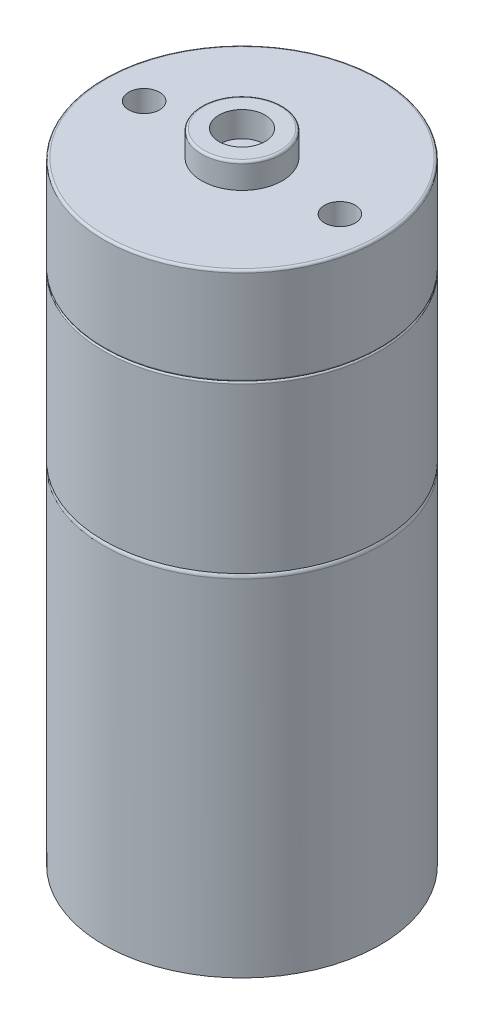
ISO-10303-21;
HEADER;
FILE_DESCRIPTION(('STEP AP214'),'2;1');
FILE_NAME('part.step','',(''),(''),'','','');
FILE_SCHEMA(('AUTOMOTIVE_DESIGN { 1 0 10303 214 1 1 1 1 }'));
ENDSEC;
DATA;
#1=APPLICATION_CONTEXT('core data for automotive mechanical design processes');
#2=APPLICATION_PROTOCOL_DEFINITION('international standard','automotive_design',2000,#1);
#3=PRODUCT_CONTEXT('',#1,'mechanical');
#4=PRODUCT('Part','Part','',(#3));
#5=PRODUCT_RELATED_PRODUCT_CATEGORY('part','',(#4));
#6=PRODUCT_DEFINITION_FORMATION('','',#4);
#7=PRODUCT_DEFINITION_CONTEXT('part definition',#1,'design');
#8=PRODUCT_DEFINITION('design','',#6,#7);
#9=PRODUCT_DEFINITION_SHAPE('','',#8);
#10=(LENGTH_UNIT() NAMED_UNIT(*) SI_UNIT(.MILLI.,.METRE.));
#11=(NAMED_UNIT(*) PLANE_ANGLE_UNIT() SI_UNIT($,.RADIAN.));
#12=(NAMED_UNIT(*) SI_UNIT($,.STERADIAN.) SOLID_ANGLE_UNIT());
#13=UNCERTAINTY_MEASURE_WITH_UNIT(LENGTH_MEASURE(1.E-05),#10,'distance_accuracy_value','');
#14=(GEOMETRIC_REPRESENTATION_CONTEXT(3) GLOBAL_UNCERTAINTY_ASSIGNED_CONTEXT((#13)) GLOBAL_UNIT_ASSIGNED_CONTEXT((#10,
#11,#12)) REPRESENTATION_CONTEXT('',''));
#15=CARTESIAN_POINT('',(0.,0.,0.));
#16=DIRECTION('',(0.,0.,1.));
#17=DIRECTION('',(1.,0.,0.));
#18=AXIS2_PLACEMENT_3D('',#15,#16,#17);
#19=CARTESIAN_POINT('',(0.,30.1625,0.));
#20=DIRECTION('',(0.,-1.,0.));
#21=DIRECTION('',(0.,0.,-1.));
#22=AXIS2_PLACEMENT_3D('',#19,#20,#21);
#23=CYLINDRICAL_SURFACE('',#22,11.90625);
#24=CARTESIAN_POINT('',(0.,29.765625,0.));
#25=DIRECTION('',(0.,1.,0.));
#26=DIRECTION('',(0.,0.,1.));
#27=AXIS2_PLACEMENT_3D('',#24,#25,#26);
#28=CIRCLE('',#27,11.90625);
#29=CARTESIAN_POINT('',(0.,29.765625,-11.90625));
#30=VERTEX_POINT('',#29);
#31=EDGE_CURVE('E60',#30,#30,#28,.F.);
#32=CARTESIAN_POINT('',(0.,0.,0.));
#33=DIRECTION('',(0.,1.,0.));
#34=DIRECTION('',(0.,0.,1.));
#35=AXIS2_PLACEMENT_3D('',#32,#33,#34);
#36=CIRCLE('',#35,11.90625);
#37=CARTESIAN_POINT('',(0.,0.,-11.90625));
#38=VERTEX_POINT('',#37);
#39=EDGE_CURVE('E66',#38,#38,#36,.T.);
#40=CARTESIAN_POINT('',(0.,29.765625,-11.90625));
#41=CARTESIAN_POINT('',(0.,29.45556640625,-11.90625));
#42=CARTESIAN_POINT('',(0.,29.1455078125,-11.90625));
#43=CARTESIAN_POINT('',(0.,28.525390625,-11.90625));
#44=CARTESIAN_POINT('',(0.,28.21533203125,-11.90625));
#45=CARTESIAN_POINT('',(0.,27.59521484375,-11.90625));
#46=CARTESIAN_POINT('',(0.,27.28515625,-11.90625));
#47=CARTESIAN_POINT('',(0.,26.6650390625,-11.90625));
#48=CARTESIAN_POINT('',(0.,26.35498046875,-11.90625));
#49=CARTESIAN_POINT('',(0.,25.73486328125,-11.90625));
#50=CARTESIAN_POINT('',(0.,25.4248046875,-11.90625));
#51=CARTESIAN_POINT('',(0.,24.8046875,-11.90625));
#52=CARTESIAN_POINT('',(0.,24.49462890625,-11.90625));
#53=CARTESIAN_POINT('',(0.,23.87451171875,-11.90625));
#54=CARTESIAN_POINT('',(0.,23.564453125,-11.90625));
#55=CARTESIAN_POINT('',(0.,22.9443359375,-11.90625));
#56=CARTESIAN_POINT('',(0.,22.63427734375,-11.90625));
#57=CARTESIAN_POINT('',(0.,22.01416015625,-11.90625));
#58=CARTESIAN_POINT('',(0.,21.7041015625,-11.90625));
#59=CARTESIAN_POINT('',(0.,21.083984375,-11.90625));
#60=CARTESIAN_POINT('',(0.,20.77392578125,-11.90625));
#61=CARTESIAN_POINT('',(0.,20.15380859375,-11.90625));
#62=CARTESIAN_POINT('',(0.,19.84375,-11.90625));
#63=CARTESIAN_POINT('',(0.,19.2236328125,-11.90625));
#64=CARTESIAN_POINT('',(0.,18.91357421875,-11.90625));
#65=CARTESIAN_POINT('',(0.,18.29345703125,-11.90625));
#66=CARTESIAN_POINT('',(0.,17.9833984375,-11.90625));
#67=CARTESIAN_POINT('',(0.,17.36328125,-11.90625));
#68=CARTESIAN_POINT('',(0.,17.05322265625,-11.90625));
#69=CARTESIAN_POINT('',(0.,16.43310546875,-11.90625));
#70=CARTESIAN_POINT('',(0.,16.123046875,-11.90625));
#71=CARTESIAN_POINT('',(0.,15.5029296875,-11.90625));
#72=CARTESIAN_POINT('',(0.,15.19287109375,-11.90625));
#73=CARTESIAN_POINT('',(0.,14.57275390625,-11.90625));
#74=CARTESIAN_POINT('',(0.,14.2626953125,-11.90625));
#75=CARTESIAN_POINT('',(0.,13.642578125,-11.90625));
#76=CARTESIAN_POINT('',(0.,13.33251953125,-11.90625));
#77=CARTESIAN_POINT('',(0.,12.71240234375,-11.90625));
#78=CARTESIAN_POINT('',(0.,12.40234375,-11.90625));
#79=CARTESIAN_POINT('',(0.,11.7822265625,-11.90625));
#80=CARTESIAN_POINT('',(0.,11.47216796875,-11.90625));
#81=CARTESIAN_POINT('',(0.,10.85205078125,-11.90625));
#82=CARTESIAN_POINT('',(0.,10.5419921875,-11.90625));
#83=CARTESIAN_POINT('',(0.,9.921875,-11.90625));
#84=CARTESIAN_POINT('',(0.,9.61181640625,-11.90625));
#85=CARTESIAN_POINT('',(0.,8.99169921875,-11.90625));
#86=CARTESIAN_POINT('',(0.,8.681640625,-11.90625));
#87=CARTESIAN_POINT('',(0.,8.0615234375,-11.90625));
#88=CARTESIAN_POINT('',(0.,7.75146484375,-11.90625));
#89=CARTESIAN_POINT('',(0.,7.13134765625,-11.90625));
#90=CARTESIAN_POINT('',(0.,6.8212890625,-11.90625));
#91=CARTESIAN_POINT('',(0.,6.201171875,-11.90625));
#92=CARTESIAN_POINT('',(0.,5.89111328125,-11.90625));
#93=CARTESIAN_POINT('',(0.,5.27099609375,-11.90625));
#94=CARTESIAN_POINT('',(0.,4.9609375,-11.90625));
#95=CARTESIAN_POINT('',(0.,4.3408203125,-11.90625));
#96=CARTESIAN_POINT('',(0.,4.03076171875,-11.90625));
#97=CARTESIAN_POINT('',(0.,3.41064453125,-11.90625));
#98=CARTESIAN_POINT('',(0.,3.1005859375,-11.90625));
#99=CARTESIAN_POINT('',(0.,2.48046875,-11.90625));
#100=CARTESIAN_POINT('',(0.,2.17041015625,-11.90625));
#101=CARTESIAN_POINT('',(0.,1.55029296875,-11.90625));
#102=CARTESIAN_POINT('',(0.,1.240234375,-11.90625));
#103=CARTESIAN_POINT('',(0.,0.6201171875,-11.90625));
#104=CARTESIAN_POINT('',(0.,0.31005859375,-11.90625));
#105=CARTESIAN_POINT('',(0.,0.,-11.90625));
#106=B_SPLINE_CURVE_WITH_KNOTS('',3,(#40,#41,#42,#43,#44,#45,#46,#47,#48,#49,#50,#51,#52,#53,
#54,#55,#56,#57,#58,#59,#60,#61,#62,#63,#64,#65,#66,#67,#68,#69,#70,#71,#72,#73,#74,#75,#76,#77,
#78,#79,#80,#81,#82,#83,#84,#85,#86,#87,#88,#89,#90,#91,#92,#93,#94,#95,#96,#97,#98,#99,#100,
#101,#102,#103,#104,#105),.UNSPECIFIED.,.F.,.F.,(4,2,2,2,2,2,2,2,2,2,2,2,2,2,2,2,2,2,2,2,2,2,2,
2,2,2,2,2,2,2,2,2,4),(0.,0.930175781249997,1.8603515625,2.79052734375,3.720703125,4.65087890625,
5.5810546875,6.51123046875,7.44140624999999,8.37158203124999,9.30175781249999,10.23193359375,
11.162109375,12.09228515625,13.0224609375,13.95263671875,14.8828125,15.81298828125,
16.7431640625,17.67333984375,18.603515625,19.53369140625,20.4638671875,21.39404296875,
22.32421875,23.25439453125,24.1845703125,25.11474609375,26.044921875,26.97509765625,
27.9052734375,28.83544921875,29.765625),.UNSPECIFIED.);
#107=EDGE_CURVE('BSEAM31',#30,#38,#106,.T.);
#108=ORIENTED_EDGE('',*,*,#31,.T.);
#109=ORIENTED_EDGE('',*,*,#39,.T.);
#110=ORIENTED_EDGE('',*,*,#107,.T.);
#111=ORIENTED_EDGE('',*,*,#107,.F.);
#112=EDGE_LOOP('',(#108,#110,#109,#111));
#113=FACE_BOUND('',#112,.T.);
#114=ADVANCED_FACE('F31',(#113),#23,.T.);
#115=CARTESIAN_POINT('',(0.,0.,0.));
#116=DIRECTION('',(0.,1.,0.));
#117=DIRECTION('',(0.,0.,1.));
#118=AXIS2_PLACEMENT_3D('',#115,#116,#117);
#119=PLANE('',#118);
#120=CARTESIAN_POINT('',(0.,0.,0.));
#121=DIRECTION('',(0.,-1.,0.));
#122=DIRECTION('',(0.,0.,-1.));
#123=AXIS2_PLACEMENT_3D('',#120,#121,#122);
#124=CIRCLE('',#123,11.3109375);
#125=CARTESIAN_POINT('',(0.,0.,-11.3109375));
#126=VERTEX_POINT('',#125);
#127=EDGE_CURVE('E70',#126,#126,#124,.T.);
#128=ORIENTED_EDGE('',*,*,#127,.F.);
#129=EDGE_LOOP('',(#128));
#130=FACE_BOUND('',#129,.T.);
#131=ORIENTED_EDGE('',*,*,#39,.F.);
#132=EDGE_LOOP('',(#131));
#133=FACE_BOUND('',#132,.T.);
#134=ADVANCED_FACE('F135',(#130,#133),#119,.F.);
#135=CARTESIAN_POINT('',(0.,29.765625,0.));
#136=DIRECTION('',(0.,1.,0.));
#137=DIRECTION('',(0.,0.,1.));
#138=AXIS2_PLACEMENT_3D('',#135,#136,#137);
#139=TOROIDAL_SURFACE('',#138,11.509375,0.396875);
#140=ORIENTED_EDGE('',*,*,#31,.F.);
#141=EDGE_LOOP('',(#140));
#142=FACE_BOUND('',#141,.T.);
#143=CARTESIAN_POINT('',(0.,30.1625,0.));
#144=DIRECTION('',(0.,1.,0.));
#145=DIRECTION('',(0.,0.,1.));
#146=AXIS2_PLACEMENT_3D('',#143,#144,#145);
#147=CIRCLE('',#146,11.509375);
#148=CARTESIAN_POINT('',(0.,30.1625,11.509375));
#149=VERTEX_POINT('',#148);
#150=EDGE_CURVE('E63',#149,#149,#147,.T.);
#151=ORIENTED_EDGE('',*,*,#150,.F.);
#152=EDGE_LOOP('',(#151));
#153=FACE_BOUND('',#152,.T.);
#154=ADVANCED_FACE('F141',(#142,#153),#139,.T.);
#155=CARTESIAN_POINT('',(0.,0.79375,0.));
#156=DIRECTION('',(0.,-1.,0.));
#157=DIRECTION('',(0.,0.,-1.));
#158=AXIS2_PLACEMENT_3D('',#155,#156,#157);
#159=CYLINDRICAL_SURFACE('',#158,11.3109375);
#160=CARTESIAN_POINT('',(0.,0.79375,0.));
#161=DIRECTION('',(0.,-1.,0.));
#162=DIRECTION('',(0.,0.,-1.));
#163=AXIS2_PLACEMENT_3D('',#160,#161,#162);
#164=CIRCLE('',#163,11.3109375);
#165=CARTESIAN_POINT('',(0.,0.79375,-11.3109375));
#166=VERTEX_POINT('',#165);
#167=EDGE_CURVE('E69',#166,#166,#164,.T.);
#168=ORIENTED_EDGE('',*,*,#167,.F.);
#169=EDGE_LOOP('',(#168));
#170=FACE_BOUND('',#169,.T.);
#171=ORIENTED_EDGE('',*,*,#127,.T.);
#172=EDGE_LOOP('',(#171));
#173=FACE_BOUND('',#172,.T.);
#174=ADVANCED_FACE('F149',(#170,#173),#159,.F.);
#175=CARTESIAN_POINT('',(0.,0.79375,0.));
#176=DIRECTION('',(0.,-1.,0.));
#177=DIRECTION('',(0.,0.,-1.));
#178=AXIS2_PLACEMENT_3D('',#175,#176,#177);
#179=PLANE('',#178);
#180=ORIENTED_EDGE('',*,*,#167,.T.);
#181=EDGE_LOOP('',(#180));
#182=FACE_BOUND('',#181,.T.);
#183=ADVANCED_FACE('F173',(#182),#179,.T.);
#184=CARTESIAN_POINT('',(0.,44.45,0.));
#185=DIRECTION('',(0.,-1.,0.));
#186=DIRECTION('',(0.,0.,-1.));
#187=AXIS2_PLACEMENT_3D('',#184,#185,#186);
#188=CYLINDRICAL_SURFACE('',#187,11.90625);
#189=CARTESIAN_POINT('',(0.,44.301171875,0.));
#190=DIRECTION('',(0.,1.,0.));
#191=DIRECTION('',(0.,0.,1.));
#192=AXIS2_PLACEMENT_3D('',#189,#190,#191);
#193=CIRCLE('',#192,11.90625);
#194=CARTESIAN_POINT('',(0.,44.301171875,11.90625));
#195=VERTEX_POINT('',#194);
#196=EDGE_CURVE('E54',#195,#195,#193,.F.);
#197=ORIENTED_EDGE('',*,*,#196,.T.);
#198=EDGE_LOOP('',(#197));
#199=FACE_BOUND('',#198,.T.);
#200=CARTESIAN_POINT('',(0.,30.1625,0.));
#201=DIRECTION('',(0.,1.,0.));
#202=DIRECTION('',(0.,0.,1.));
#203=AXIS2_PLACEMENT_3D('',#200,#201,#202);
#204=CIRCLE('',#203,11.90625);
#205=CARTESIAN_POINT('',(0.,30.1625,11.90625));
#206=VERTEX_POINT('',#205);
#207=EDGE_CURVE('E73',#206,#206,#204,.T.);
#208=ORIENTED_EDGE('',*,*,#207,.T.);
#209=EDGE_LOOP('',(#208));
#210=FACE_BOUND('',#209,.T.);
#211=ADVANCED_FACE('F161',(#199,#210),#188,.T.);
#212=CARTESIAN_POINT('',(0.,30.1625,0.));
#213=DIRECTION('',(0.,1.,0.));
#214=DIRECTION('',(0.,0.,1.));
#215=AXIS2_PLACEMENT_3D('',#212,#213,#214);
#216=PLANE('',#215);
#217=ORIENTED_EDGE('',*,*,#150,.T.);
#218=EDGE_LOOP('',(#217));
#219=FACE_BOUND('',#218,.T.);
#220=ORIENTED_EDGE('',*,*,#207,.F.);
#221=EDGE_LOOP('',(#220));
#222=FACE_BOUND('',#221,.T.);
#223=ADVANCED_FACE('F153',(#219,#222),#216,.F.);
#224=CARTESIAN_POINT('',(0.,44.301171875,0.));
#225=DIRECTION('',(0.,1.,0.));
#226=DIRECTION('',(0.,0.,1.));
#227=AXIS2_PLACEMENT_3D('',#224,#225,#226);
#228=TOROIDAL_SURFACE('',#227,11.757421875,0.148828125);
#229=ORIENTED_EDGE('',*,*,#196,.F.);
#230=EDGE_LOOP('',(#229));
#231=FACE_BOUND('',#230,.T.);
#232=CARTESIAN_POINT('',(0.,44.45,0.));
#233=DIRECTION('',(0.,1.,0.));
#234=DIRECTION('',(0.,0.,1.));
#235=AXIS2_PLACEMENT_3D('',#232,#233,#234);
#236=CIRCLE('',#235,11.757421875);
#237=CARTESIAN_POINT('',(0.,44.45,11.757421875));
#238=VERTEX_POINT('',#237);
#239=EDGE_CURVE('E57',#238,#238,#236,.T.);
#240=ORIENTED_EDGE('',*,*,#239,.F.);
#241=EDGE_LOOP('',(#240));
#242=FACE_BOUND('',#241,.T.);
#243=ADVANCED_FACE('F151',(#231,#242),#228,.T.);
#244=CARTESIAN_POINT('',(0.,52.784375,0.));
#245=DIRECTION('',(0.,-1.,0.));
#246=DIRECTION('',(0.,0.,-1.));
#247=AXIS2_PLACEMENT_3D('',#244,#245,#246);
#248=CYLINDRICAL_SURFACE('',#247,11.90625);
#249=CARTESIAN_POINT('',(0.,52.5859375,0.));
#250=DIRECTION('',(0.,1.,0.));
#251=DIRECTION('',(0.,0.,1.));
#252=AXIS2_PLACEMENT_3D('',#249,#250,#251);
#253=CIRCLE('',#252,11.90625);
#254=CARTESIAN_POINT('',(0.,52.5859375,11.90625));
#255=VERTEX_POINT('',#254);
#256=EDGE_CURVE('E42',#255,#255,#253,.F.);
#257=ORIENTED_EDGE('',*,*,#256,.T.);
#258=EDGE_LOOP('',(#257));
#259=FACE_BOUND('',#258,.T.);
#260=CARTESIAN_POINT('',(0.,44.598828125,0.));
#261=DIRECTION('',(0.,1.,0.));
#262=DIRECTION('',(0.,0.,1.));
#263=AXIS2_PLACEMENT_3D('',#260,#261,#262);
#264=CIRCLE('',#263,11.90625);
#265=CARTESIAN_POINT('',(0.,44.598828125,11.90625));
#266=VERTEX_POINT('',#265);
#267=EDGE_CURVE('E51',#266,#266,#264,.T.);
#268=ORIENTED_EDGE('',*,*,#267,.T.);
#269=EDGE_LOOP('',(#268));
#270=FACE_BOUND('',#269,.T.);
#271=ADVANCED_FACE('F113',(#259,#270),#248,.T.);
#272=CARTESIAN_POINT('',(0.,52.784375,0.));
#273=DIRECTION('',(0.,1.,0.));
#274=DIRECTION('',(0.,0.,1.));
#275=AXIS2_PLACEMENT_3D('',#272,#273,#274);
#276=PLANE('',#275);
#277=CARTESIAN_POINT('',(8.4328,52.784375,0.));
#278=DIRECTION('',(0.,1.,0.));
#279=DIRECTION('',(0.,0.,1.));
#280=AXIS2_PLACEMENT_3D('',#277,#278,#279);
#281=CIRCLE('',#280,1.32715);
#282=CARTESIAN_POINT('',(8.4328,52.784375,1.32715));
#283=VERTEX_POINT('',#282);
#284=EDGE_CURVE('E94',#283,#283,#281,.T.);
#285=ORIENTED_EDGE('',*,*,#284,.F.);
#286=EDGE_LOOP('',(#285));
#287=FACE_BOUND('',#286,.T.);
#288=CARTESIAN_POINT('',(-8.4328,52.784375,0.));
#289=DIRECTION('',(0.,1.,0.));
#290=DIRECTION('',(0.,0.,1.));
#291=AXIS2_PLACEMENT_3D('',#288,#289,#290);
#292=CIRCLE('',#291,1.32715);
#293=CARTESIAN_POINT('',(-8.4328,52.784375,1.32715));
#294=VERTEX_POINT('',#293);
#295=EDGE_CURVE('E88',#294,#294,#292,.T.);
#296=ORIENTED_EDGE('',*,*,#295,.F.);
#297=EDGE_LOOP('',(#296));
#298=FACE_BOUND('',#297,.T.);
#299=CARTESIAN_POINT('',(0.,52.784375,0.));
#300=DIRECTION('',(0.,1.,0.));
#301=DIRECTION('',(0.,0.,1.));
#302=AXIS2_PLACEMENT_3D('',#299,#300,#301);
#303=CIRCLE('',#302,3.47265625);
#304=CARTESIAN_POINT('',(0.,52.784375,3.47265625));
#305=VERTEX_POINT('',#304);
#306=EDGE_CURVE('E78',#305,#305,#303,.T.);
#307=ORIENTED_EDGE('',*,*,#306,.F.);
#308=EDGE_LOOP('',(#307));
#309=FACE_BOUND('',#308,.T.);
#310=CARTESIAN_POINT('',(0.,52.784375,0.));
#311=DIRECTION('',(0.,1.,0.));
#312=DIRECTION('',(0.,0.,1.));
#313=AXIS2_PLACEMENT_3D('',#310,#311,#312);
#314=CIRCLE('',#313,11.7078125);
#315=CARTESIAN_POINT('',(0.,52.784375,11.7078125));
#316=VERTEX_POINT('',#315);
#317=EDGE_CURVE('E46',#316,#316,#314,.T.);
#318=ORIENTED_EDGE('',*,*,#317,.T.);
#319=EDGE_LOOP('',(#318));
#320=FACE_BOUND('',#319,.T.);
#321=ADVANCED_FACE('F109',(#287,#298,#309,#320),#276,.T.);
#322=CARTESIAN_POINT('',(0.,44.598828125,0.));
#323=DIRECTION('',(0.,1.,0.));
#324=DIRECTION('',(0.,0.,1.));
#325=AXIS2_PLACEMENT_3D('',#322,#323,#324);
#326=TOROIDAL_SURFACE('',#325,11.757421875,0.148828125);
#327=ORIENTED_EDGE('',*,*,#239,.T.);
#328=EDGE_LOOP('',(#327));
#329=FACE_BOUND('',#328,.T.);
#330=ORIENTED_EDGE('',*,*,#267,.F.);
#331=EDGE_LOOP('',(#330));
#332=FACE_BOUND('',#331,.T.);
#333=ADVANCED_FACE('F112',(#329,#332),#326,.T.);
#334=CARTESIAN_POINT('',(0.,52.5859375,0.));
#335=DIRECTION('',(0.,1.,0.));
#336=DIRECTION('',(0.,0.,1.));
#337=AXIS2_PLACEMENT_3D('',#334,#335,#336);
#338=TOROIDAL_SURFACE('',#337,11.7078125,0.1984375);
#339=ORIENTED_EDGE('',*,*,#256,.F.);
#340=EDGE_LOOP('',(#339));
#341=FACE_BOUND('',#340,.T.);
#342=ORIENTED_EDGE('',*,*,#317,.F.);
#343=EDGE_LOOP('',(#342));
#344=FACE_BOUND('',#343,.T.);
#345=ADVANCED_FACE('F121',(#341,#344),#338,.T.);
#346=CARTESIAN_POINT('',(0.,54.9671875,0.));
#347=DIRECTION('',(0.,-1.,0.));
#348=DIRECTION('',(0.,0.,-1.));
#349=AXIS2_PLACEMENT_3D('',#346,#347,#348);
#350=CYLINDRICAL_SURFACE('',#349,3.47265625);
#351=CARTESIAN_POINT('',(0.,54.76875,0.));
#352=DIRECTION('',(0.,1.,0.));
#353=DIRECTION('',(0.,0.,1.));
#354=AXIS2_PLACEMENT_3D('',#351,#352,#353);
#355=CIRCLE('',#354,3.47265625);
#356=CARTESIAN_POINT('',(0.,54.76875,3.47265625));
#357=VERTEX_POINT('',#356);
#358=EDGE_CURVE('E10',#357,#357,#355,.F.);
#359=ORIENTED_EDGE('',*,*,#358,.T.);
#360=EDGE_LOOP('',(#359));
#361=FACE_BOUND('',#360,.T.);
#362=ORIENTED_EDGE('',*,*,#306,.T.);
#363=EDGE_LOOP('',(#362));
#364=FACE_BOUND('',#363,.T.);
#365=ADVANCED_FACE('F123',(#361,#364),#350,.T.);
#366=CARTESIAN_POINT('',(0.,54.9671875,0.));
#367=DIRECTION('',(0.,1.,0.));
#368=DIRECTION('',(0.,0.,1.));
#369=AXIS2_PLACEMENT_3D('',#366,#367,#368);
#370=PLANE('',#369);
#371=CARTESIAN_POINT('',(0.,54.9671875,0.));
#372=DIRECTION('',(0.,1.,0.));
#373=DIRECTION('',(0.,0.,1.));
#374=AXIS2_PLACEMENT_3D('',#371,#372,#373);
#375=CIRCLE('',#374,1.984375);
#376=CARTESIAN_POINT('',(0.,54.9671875,1.984375));
#377=VERTEX_POINT('',#376);
#378=EDGE_CURVE('E82',#377,#377,#375,.T.);
#379=ORIENTED_EDGE('',*,*,#378,.F.);
#380=EDGE_LOOP('',(#379));
#381=FACE_BOUND('',#380,.T.);
#382=CARTESIAN_POINT('',(0.,54.9671875,0.));
#383=DIRECTION('',(0.,1.,0.));
#384=DIRECTION('',(0.,0.,1.));
#385=AXIS2_PLACEMENT_3D('',#382,#383,#384);
#386=CIRCLE('',#385,3.27421875);
#387=CARTESIAN_POINT('',(0.,54.9671875,3.27421875));
#388=VERTEX_POINT('',#387);
#389=EDGE_CURVE('E38',#388,#388,#386,.T.);
#390=ORIENTED_EDGE('',*,*,#389,.T.);
#391=EDGE_LOOP('',(#390));
#392=FACE_BOUND('',#391,.T.);
#393=ADVANCED_FACE('F129',(#381,#392),#370,.T.);
#394=CARTESIAN_POINT('',(0.,54.76875,0.));
#395=DIRECTION('',(0.,1.,0.));
#396=DIRECTION('',(0.,0.,1.));
#397=AXIS2_PLACEMENT_3D('',#394,#395,#396);
#398=TOROIDAL_SURFACE('',#397,3.27421875,0.1984375);
#399=ORIENTED_EDGE('',*,*,#358,.F.);
#400=EDGE_LOOP('',(#399));
#401=FACE_BOUND('',#400,.T.);
#402=ORIENTED_EDGE('',*,*,#389,.F.);
#403=EDGE_LOOP('',(#402));
#404=FACE_BOUND('',#403,.T.);
#405=ADVANCED_FACE('F33',(#401,#404),#398,.T.);
#406=CARTESIAN_POINT('',(0.,52.784375,0.));
#407=DIRECTION('',(0.,1.,0.));
#408=DIRECTION('',(0.,0.,1.));
#409=AXIS2_PLACEMENT_3D('',#406,#407,#408);
#410=CYLINDRICAL_SURFACE('',#409,1.984375);
#411=CARTESIAN_POINT('',(0.,52.784375,0.));
#412=DIRECTION('',(0.,1.,0.));
#413=DIRECTION('',(0.,0.,1.));
#414=AXIS2_PLACEMENT_3D('',#411,#412,#413);
#415=CIRCLE('',#414,1.984375);
#416=CARTESIAN_POINT('',(0.,52.784375,1.984375));
#417=VERTEX_POINT('',#416);
#418=EDGE_CURVE('E81',#417,#417,#415,.T.);
#419=ORIENTED_EDGE('',*,*,#418,.F.);
#420=EDGE_LOOP('',(#419));
#421=FACE_BOUND('',#420,.T.);
#422=ORIENTED_EDGE('',*,*,#378,.T.);
#423=EDGE_LOOP('',(#422));
#424=FACE_BOUND('',#423,.T.);
#425=ADVANCED_FACE('F246',(#421,#424),#410,.F.);
#426=CARTESIAN_POINT('',(0.,52.784375,0.));
#427=DIRECTION('',(0.,1.,0.));
#428=DIRECTION('',(0.,0.,1.));
#429=AXIS2_PLACEMENT_3D('',#426,#427,#428);
#430=PLANE('',#429);
#431=ORIENTED_EDGE('',*,*,#418,.T.);
#432=EDGE_LOOP('',(#431));
#433=FACE_BOUND('',#432,.T.);
#434=ADVANCED_FACE('F262',(#433),#430,.T.);
#435=CARTESIAN_POINT('',(-8.4328,47.704375,0.));
#436=DIRECTION('',(0.,1.,0.));
#437=DIRECTION('',(0.,0.,1.));
#438=AXIS2_PLACEMENT_3D('',#435,#436,#437);
#439=CYLINDRICAL_SURFACE('',#438,1.32715);
#440=CARTESIAN_POINT('',(-8.4328,47.704375,0.));
#441=DIRECTION('',(0.,1.,0.));
#442=DIRECTION('',(0.,0.,1.));
#443=AXIS2_PLACEMENT_3D('',#440,#441,#442);
#444=CIRCLE('',#443,1.32715);
#445=CARTESIAN_POINT('',(-8.4328,47.704375,1.32715));
#446=VERTEX_POINT('',#445);
#447=EDGE_CURVE('E91',#446,#446,#444,.T.);
#448=ORIENTED_EDGE('',*,*,#447,.F.);
#449=EDGE_LOOP('',(#448));
#450=FACE_BOUND('',#449,.T.);
#451=ORIENTED_EDGE('',*,*,#295,.T.);
#452=EDGE_LOOP('',(#451));
#453=FACE_BOUND('',#452,.T.);
#454=ADVANCED_FACE('F272',(#450,#453),#439,.F.);
#455=CARTESIAN_POINT('',(-8.4328,47.704375,0.));
#456=DIRECTION('',(0.,1.,0.));
#457=DIRECTION('',(0.,0.,1.));
#458=AXIS2_PLACEMENT_3D('',#455,#456,#457);
#459=PLANE('',#458);
#460=ORIENTED_EDGE('',*,*,#447,.T.);
#461=EDGE_LOOP('',(#460));
#462=FACE_BOUND('',#461,.T.);
#463=ADVANCED_FACE('F105',(#462),#459,.T.);
#464=CARTESIAN_POINT('',(8.4328,47.704375,0.));
#465=DIRECTION('',(0.,1.,0.));
#466=DIRECTION('',(0.,0.,1.));
#467=AXIS2_PLACEMENT_3D('',#464,#465,#466);
#468=CYLINDRICAL_SURFACE('',#467,1.32715);
#469=CARTESIAN_POINT('',(8.4328,47.704375,0.));
#470=DIRECTION('',(0.,1.,0.));
#471=DIRECTION('',(0.,0.,1.));
#472=AXIS2_PLACEMENT_3D('',#469,#470,#471);
#473=CIRCLE('',#472,1.32715);
#474=CARTESIAN_POINT('',(8.4328,47.704375,1.32715));
#475=VERTEX_POINT('',#474);
#476=EDGE_CURVE('E85',#475,#475,#473,.T.);
#477=ORIENTED_EDGE('',*,*,#476,.F.);
#478=EDGE_LOOP('',(#477));
#479=FACE_BOUND('',#478,.T.);
#480=ORIENTED_EDGE('',*,*,#284,.T.);
#481=EDGE_LOOP('',(#480));
#482=FACE_BOUND('',#481,.T.);
#483=ADVANCED_FACE('F102',(#479,#482),#468,.F.);
#484=CARTESIAN_POINT('',(8.4328,47.704375,0.));
#485=DIRECTION('',(0.,1.,0.));
#486=DIRECTION('',(0.,0.,1.));
#487=AXIS2_PLACEMENT_3D('',#484,#485,#486);
#488=PLANE('',#487);
#489=ORIENTED_EDGE('',*,*,#476,.T.);
#490=EDGE_LOOP('',(#489));
#491=FACE_BOUND('',#490,.T.);
#492=ADVANCED_FACE('F100',(#491),#488,.T.);
#493=CLOSED_SHELL('',(#114,#134,#154,#174,#183,#211,#223,#243,#271,#321,#333,#345,#365,#393,
#405,#425,#434,#454,#463,#483,#492));
#494=MANIFOLD_SOLID_BREP('B2',#493);
#495=ADVANCED_BREP_SHAPE_REPRESENTATION('',(#18,#494),#14);
#496=SHAPE_DEFINITION_REPRESENTATION(#9,#495);
ENDSEC;
END-ISO-10303-21;
